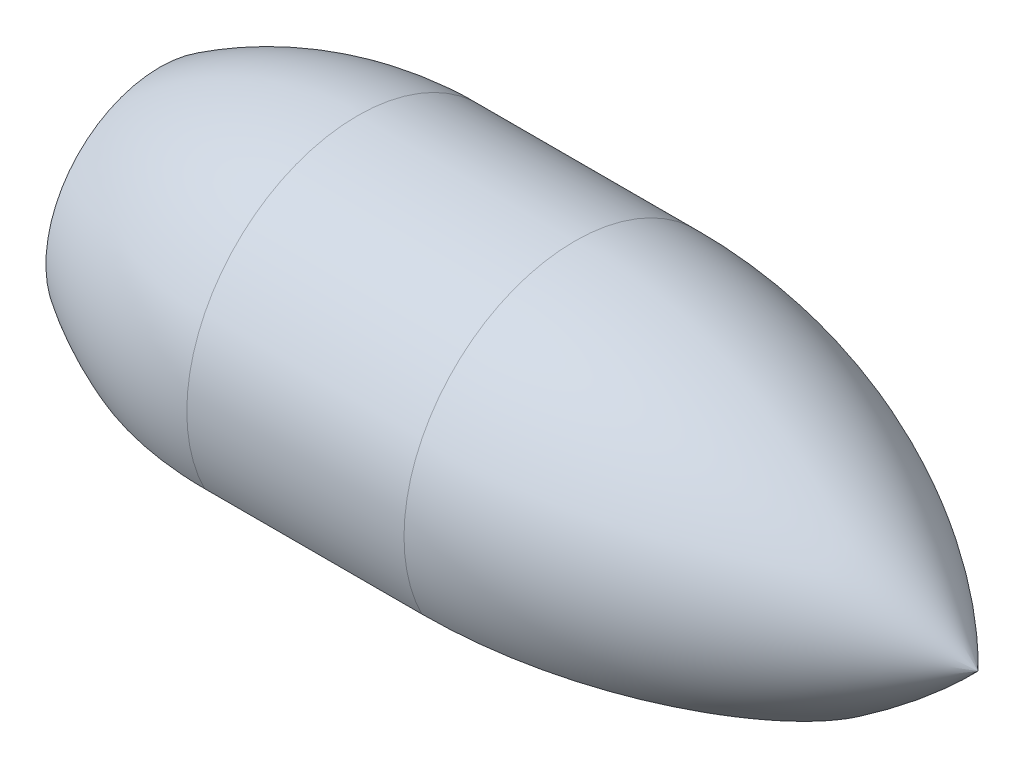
from build123d import *

# Parameters (mm, degrees)
SKETCH2_R          = 18.288
EXTRUDE1_DEPTH     = 87.63
SKETCH5_R          = 7.9375
CUT_EXTRUDE2_DEPTH = 24.13
SKETCH4_W          = 32.789784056
SKETCH4_H          = 12.534509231
CUT_EXTRUDE1_DEPTH = 92.366945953


with BuildPart() as part:
    # Sketch2 → Extrude1 (new body)
    with BuildSketch(Plane(origin=(0, 0, 0), x_dir=(0, 0, -1), z_dir=(1, 0, 0))):
        Circle(SKETCH2_R)
    extrude(amount=EXTRUDE1_DEPTH)

    # Sketch3 → shape (revolve, cut)
    with BuildSketch(Plane.XY, mode=Mode.PRIVATE) as shape_sk:
        with BuildLine():
            Line((87.63, 0.008772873), (87.63, 18.288))
            Line((87.63, 18.288), (44.45, 18.288))
            ThreePointArc((44.45, 18.288), (67.89484242, 13.529977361), (87.63, 0.008772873))
        make_face()
        with BuildLine():
            Line((21.184856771, 18.288), (0, 18.288))
            Line((0, 18.288), (0, 12.192))
            ThreePointArc((0, 12.192), (10.162613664, 16.733694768), (21.184856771, 18.288))
        make_face()
    revolve(shape_sk.sketch.rotate(Axis((0, 0, 0), (1, 0, 0)), 90), axis=Axis((0, 0, 0), (1, 0, 0)), mode=Mode.SUBTRACT)

    # Sketch5 → Cut-Extrude2 (cut)
    with BuildSketch(Plane.ZY):
        Circle(SKETCH5_R)
    extrude(amount=-CUT_EXTRUDE2_DEPTH, mode=Mode.SUBTRACT)

    # Sketch4 → Cut-Extrude1 (cut, through all)
    with BuildSketch(Plane.ZY):
        with Locations((0, -14.370245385)):
            Rectangle(SKETCH4_W, SKETCH4_H)
    extrude(amount=-CUT_EXTRUDE1_DEPTH, mode=Mode.SUBTRACT)


solid = part.part
